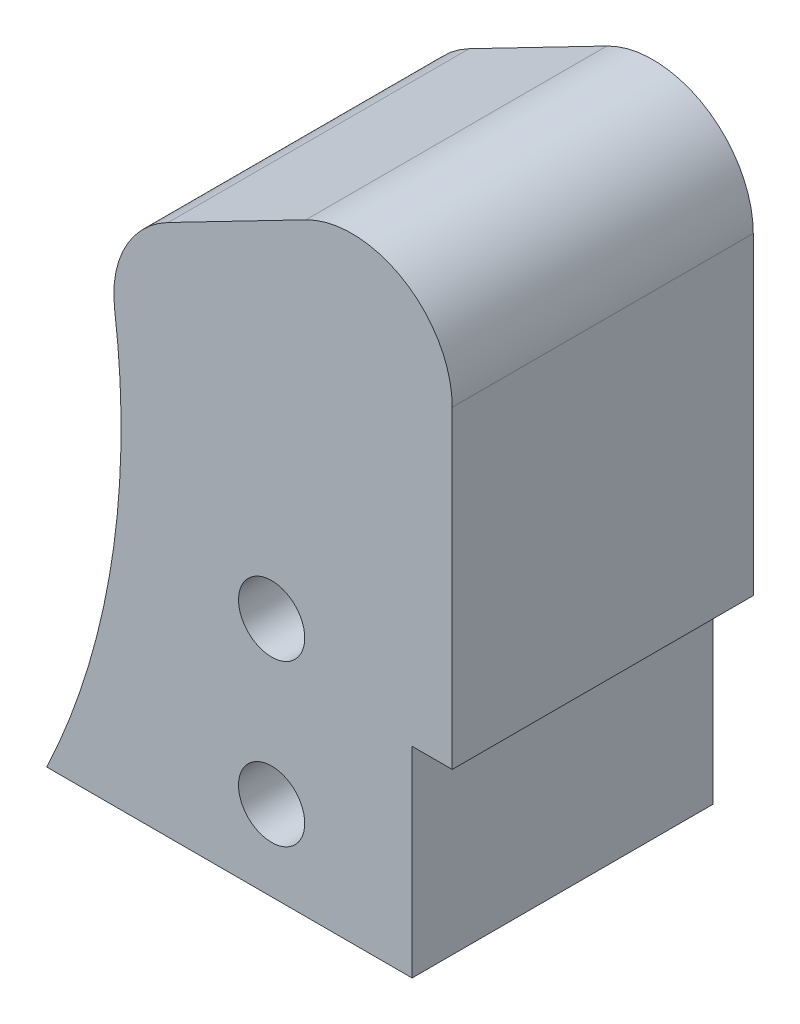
ISO-10303-21;
HEADER;
FILE_DESCRIPTION(('STEP AP214'),'2;1');
FILE_NAME('part.step','',(''),(''),'','','');
FILE_SCHEMA(('AUTOMOTIVE_DESIGN { 1 0 10303 214 1 1 1 1 }'));
ENDSEC;
DATA;
#1=APPLICATION_CONTEXT('core data for automotive mechanical design processes');
#2=APPLICATION_PROTOCOL_DEFINITION('international standard','automotive_design',2000,#1);
#3=PRODUCT_CONTEXT('',#1,'mechanical');
#4=PRODUCT('Part','Part','',(#3));
#5=PRODUCT_RELATED_PRODUCT_CATEGORY('part','',(#4));
#6=PRODUCT_DEFINITION_FORMATION('','',#4);
#7=PRODUCT_DEFINITION_CONTEXT('part definition',#1,'design');
#8=PRODUCT_DEFINITION('design','',#6,#7);
#9=PRODUCT_DEFINITION_SHAPE('','',#8);
#10=(LENGTH_UNIT() NAMED_UNIT(*) SI_UNIT(.MILLI.,.METRE.));
#11=(NAMED_UNIT(*) PLANE_ANGLE_UNIT() SI_UNIT($,.RADIAN.));
#12=(NAMED_UNIT(*) SI_UNIT($,.STERADIAN.) SOLID_ANGLE_UNIT());
#13=UNCERTAINTY_MEASURE_WITH_UNIT(LENGTH_MEASURE(1.E-05),#10,'distance_accuracy_value','');
#14=(GEOMETRIC_REPRESENTATION_CONTEXT(3) GLOBAL_UNCERTAINTY_ASSIGNED_CONTEXT((#13)) GLOBAL_UNIT_ASSIGNED_CONTEXT((#10,
#11,#12)) REPRESENTATION_CONTEXT('',''));
#15=CARTESIAN_POINT('',(0.,0.,0.));
#16=DIRECTION('',(0.,0.,1.));
#17=DIRECTION('',(1.,0.,0.));
#18=AXIS2_PLACEMENT_3D('',#15,#16,#17);
#19=CARTESIAN_POINT('',(50.,-1.16800875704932,8.));
#20=DIRECTION('',(0.,0.,1.));
#21=DIRECTION('',(1.,0.,0.));
#22=AXIS2_PLACEMENT_3D('',#19,#20,#21);
#23=CYLINDRICAL_SURFACE('',#22,5.);
#24=CARTESIAN_POINT('',(50.,-1.16800875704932,8.));
#25=DIRECTION('',(0.,0.,-1.));
#26=DIRECTION('',(1.,0.,0.));
#27=AXIS2_PLACEMENT_3D('',#24,#25,#26);
#28=CIRCLE('',#27,5.);
#29=CARTESIAN_POINT('',(47.7037551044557,3.27352919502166,8.));
#30=VERTEX_POINT('',#29);
#31=CARTESIAN_POINT('',(55.,-1.16800875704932,8.));
#32=VERTEX_POINT('',#31);
#33=EDGE_CURVE('E98',#30,#32,#28,.T.);
#34=ORIENTED_EDGE('',*,*,#33,.F.);
#35=DIRECTION('',(0.,0.,-1.));
#36=VECTOR('',#35,1.);
#37=CARTESIAN_POINT('',(47.7037551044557,3.27352919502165,8.));
#38=LINE('',#37,#36);
#39=CARTESIAN_POINT('',(47.7037551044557,3.27352919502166,23.));
#40=VERTEX_POINT('',#39);
#41=EDGE_CURVE('E26',#40,#30,#38,.T.);
#42=ORIENTED_EDGE('',*,*,#41,.F.);
#43=CARTESIAN_POINT('',(50.,-1.16800875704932,23.));
#44=DIRECTION('',(0.,0.,1.));
#45=DIRECTION('',(1.,0.,0.));
#46=AXIS2_PLACEMENT_3D('',#43,#44,#45);
#47=CIRCLE('',#46,5.);
#48=CARTESIAN_POINT('',(55.,-1.16800875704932,23.));
#49=VERTEX_POINT('',#48);
#50=EDGE_CURVE('E96',#49,#40,#47,.T.);
#51=ORIENTED_EDGE('',*,*,#50,.F.);
#52=DIRECTION('',(0.,0.,1.));
#53=VECTOR('',#52,1.);
#54=CARTESIAN_POINT('',(55.,-1.16800875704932,8.));
#55=LINE('',#54,#53);
#56=EDGE_CURVE('E135',#32,#49,#55,.T.);
#57=ORIENTED_EDGE('',*,*,#56,.F.);
#58=EDGE_LOOP('',(#34,#42,#51,#57));
#59=FACE_BOUND('',#58,.T.);
#60=ADVANCED_FACE('F17',(#59),#23,.T.);
#61=CARTESIAN_POINT('',(8.72573060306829,-16.8778442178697,8.));
#62=DIRECTION('',(0.459248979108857,-0.888307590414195,0.));
#63=DIRECTION('',(0.,0.,-1.));
#64=AXIS2_PLACEMENT_3D('',#61,#62,#63);
#65=PLANE('',#64);
#66=DIRECTION('',(0.888307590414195,0.459248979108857,0.));
#67=VECTOR('',#66,1.);
#68=CARTESIAN_POINT('',(8.72573060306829,-16.8778442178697,23.));
#69=LINE('',#68,#67);
#70=CARTESIAN_POINT('',(40.8418007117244,-0.274054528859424,23.));
#71=VERTEX_POINT('',#70);
#72=EDGE_CURVE('E101',#71,#40,#69,.T.);
#73=ORIENTED_EDGE('',*,*,#72,.T.);
#74=ORIENTED_EDGE('',*,*,#41,.T.);
#75=DIRECTION('',(0.888307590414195,0.459248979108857,0.));
#76=VECTOR('',#75,1.);
#77=CARTESIAN_POINT('',(8.72573060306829,-16.8778442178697,8.));
#78=LINE('',#77,#76);
#79=CARTESIAN_POINT('',(40.8418007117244,-0.274054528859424,8.));
#80=VERTEX_POINT('',#79);
#81=EDGE_CURVE('E106',#80,#30,#78,.T.);
#82=ORIENTED_EDGE('',*,*,#81,.F.);
#83=DIRECTION('',(0.,0.,1.));
#84=VECTOR('',#83,1.);
#85=CARTESIAN_POINT('',(40.8418007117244,-0.274054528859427,23.));
#86=LINE('',#85,#84);
#87=EDGE_CURVE('E11',#80,#71,#86,.T.);
#88=ORIENTED_EDGE('',*,*,#87,.T.);
#89=EDGE_LOOP('',(#73,#74,#82,#88));
#90=FACE_BOUND('',#89,.T.);
#91=ADVANCED_FACE('F102',(#90),#65,.F.);
#92=CARTESIAN_POINT('',(0.,0.,8.));
#93=DIRECTION('',(0.,0.,1.));
#94=DIRECTION('',(1.,0.,0.));
#95=AXIS2_PLACEMENT_3D('',#92,#93,#94);
#96=PLANE('',#95);
#97=CARTESIAN_POINT('',(46.,-22.7966896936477,8.));
#98=DIRECTION('',(0.,0.,-1.));
#99=DIRECTION('',(1.,0.,0.));
#100=AXIS2_PLACEMENT_3D('',#97,#98,#99);
#101=CIRCLE('',#100,1.65);
#102=CARTESIAN_POINT('',(47.65,-22.7966896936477,8.));
#103=VERTEX_POINT('',#102);
#104=EDGE_CURVE('E139',#103,#103,#101,.T.);
#105=ORIENTED_EDGE('',*,*,#104,.F.);
#106=EDGE_LOOP('',(#105));
#107=FACE_BOUND('',#106,.T.);
#108=CARTESIAN_POINT('',(46.,-14.7966896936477,8.));
#109=DIRECTION('',(0.,0.,-1.));
#110=DIRECTION('',(1.,0.,0.));
#111=AXIS2_PLACEMENT_3D('',#108,#109,#110);
#112=CIRCLE('',#111,1.65);
#113=CARTESIAN_POINT('',(47.65,-14.7966896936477,8.));
#114=VERTEX_POINT('',#113);
#115=EDGE_CURVE('E133',#114,#114,#112,.T.);
#116=ORIENTED_EDGE('',*,*,#115,.F.);
#117=EDGE_LOOP('',(#116));
#118=FACE_BOUND('',#117,.T.);
#119=ORIENTED_EDGE('',*,*,#81,.T.);
#120=ORIENTED_EDGE('',*,*,#33,.T.);
#121=DIRECTION('',(0.,1.,0.));
#122=VECTOR('',#121,1.);
#123=CARTESIAN_POINT('',(55.,-68.,8.));
#124=LINE('',#123,#122);
#125=CARTESIAN_POINT('',(55.,-16.7966896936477,8.));
#126=VERTEX_POINT('',#125);
#127=EDGE_CURVE('E138',#126,#32,#124,.T.);
#128=ORIENTED_EDGE('',*,*,#127,.F.);
#129=DIRECTION('',(1.,0.,0.));
#130=VECTOR('',#129,1.);
#131=CARTESIAN_POINT('',(0.,-16.7966896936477,8.));
#132=LINE('',#131,#130);
#133=CARTESIAN_POINT('',(53.,-16.7966896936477,8.));
#134=VERTEX_POINT('',#133);
#135=EDGE_CURVE('E119',#134,#126,#132,.T.);
#136=ORIENTED_EDGE('',*,*,#135,.F.);
#137=DIRECTION('',(0.,1.,0.));
#138=VECTOR('',#137,1.);
#139=CARTESIAN_POINT('',(53.,0.,8.));
#140=LINE('',#139,#138);
#141=CARTESIAN_POINT('',(53.,-26.7966896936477,8.));
#142=VERTEX_POINT('',#141);
#143=EDGE_CURVE('E168',#142,#134,#140,.T.);
#144=ORIENTED_EDGE('',*,*,#143,.F.);
#145=DIRECTION('',(1.,0.,0.));
#146=VECTOR('',#145,1.);
#147=CARTESIAN_POINT('',(0.,-26.7966896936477,8.));
#148=LINE('',#147,#146);
#149=CARTESIAN_POINT('',(34.7939729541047,-26.7966896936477,8.));
#150=VERTEX_POINT('',#149);
#151=EDGE_CURVE('E159',#150,#142,#148,.T.);
#152=ORIENTED_EDGE('',*,*,#151,.F.);
#153=CARTESIAN_POINT('',(0.,-10.3155050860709,8.));
#154=DIRECTION('',(0.,0.,1.));
#155=DIRECTION('',(1.,0.,0.));
#156=AXIS2_PLACEMENT_3D('',#153,#154,#155);
#157=CIRCLE('',#156,38.5);
#158=CARTESIAN_POINT('',(38.1796495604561,-5.35926059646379,8.));
#159=VERTEX_POINT('',#158);
#160=EDGE_CURVE('E152',#150,#159,#157,.T.);
#161=ORIENTED_EDGE('',*,*,#160,.T.);
#162=CARTESIAN_POINT('',(43.1380456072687,-4.7155924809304,8.));
#163=DIRECTION('',(0.,0.,-1.));
#164=DIRECTION('',(1.,0.,0.));
#165=AXIS2_PLACEMENT_3D('',#162,#163,#164);
#166=CIRCLE('',#165,5.);
#167=EDGE_CURVE('E52',#159,#80,#166,.T.);
#168=ORIENTED_EDGE('',*,*,#167,.T.);
#169=EDGE_LOOP('',(#119,#120,#128,#136,#144,#152,#161,#168));
#170=FACE_BOUND('',#169,.T.);
#171=ADVANCED_FACE('F19',(#107,#118,#170),#96,.F.);
#172=CARTESIAN_POINT('',(0.,0.,23.));
#173=DIRECTION('',(0.,0.,1.));
#174=DIRECTION('',(1.,0.,0.));
#175=AXIS2_PLACEMENT_3D('',#172,#173,#174);
#176=PLANE('',#175);
#177=CARTESIAN_POINT('',(46.,-14.7966896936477,23.));
#178=DIRECTION('',(0.,0.,-1.));
#179=DIRECTION('',(1.,0.,0.));
#180=AXIS2_PLACEMENT_3D('',#177,#178,#179);
#181=CIRCLE('',#180,1.65);
#182=CARTESIAN_POINT('',(47.65,-14.7966896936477,23.));
#183=VERTEX_POINT('',#182);
#184=EDGE_CURVE('E208',#183,#183,#181,.T.);
#185=ORIENTED_EDGE('',*,*,#184,.T.);
#186=EDGE_LOOP('',(#185));
#187=FACE_BOUND('',#186,.T.);
#188=CARTESIAN_POINT('',(46.,-22.7966896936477,23.));
#189=DIRECTION('',(0.,0.,-1.));
#190=DIRECTION('',(1.,0.,0.));
#191=AXIS2_PLACEMENT_3D('',#188,#189,#190);
#192=CIRCLE('',#191,1.65);
#193=CARTESIAN_POINT('',(47.65,-22.7966896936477,23.));
#194=VERTEX_POINT('',#193);
#195=EDGE_CURVE('E143',#194,#194,#192,.T.);
#196=ORIENTED_EDGE('',*,*,#195,.T.);
#197=EDGE_LOOP('',(#196));
#198=FACE_BOUND('',#197,.T.);
#199=DIRECTION('',(0.,1.,0.));
#200=VECTOR('',#199,1.);
#201=CARTESIAN_POINT('',(55.,0.,23.));
#202=LINE('',#201,#200);
#203=CARTESIAN_POINT('',(55.,-16.7966896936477,23.));
#204=VERTEX_POINT('',#203);
#205=EDGE_CURVE('E110',#204,#49,#202,.T.);
#206=ORIENTED_EDGE('',*,*,#205,.T.);
#207=ORIENTED_EDGE('',*,*,#50,.T.);
#208=ORIENTED_EDGE('',*,*,#72,.F.);
#209=CARTESIAN_POINT('',(43.1380456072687,-4.7155924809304,23.));
#210=DIRECTION('',(0.,0.,1.));
#211=DIRECTION('',(1.,0.,0.));
#212=AXIS2_PLACEMENT_3D('',#209,#210,#211);
#213=CIRCLE('',#212,5.);
#214=CARTESIAN_POINT('',(38.1796495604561,-5.35926059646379,23.));
#215=VERTEX_POINT('',#214);
#216=EDGE_CURVE('E195',#71,#215,#213,.T.);
#217=ORIENTED_EDGE('',*,*,#216,.T.);
#218=CARTESIAN_POINT('',(0.,-10.3155050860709,23.));
#219=DIRECTION('',(0.,0.,1.));
#220=DIRECTION('',(1.,0.,0.));
#221=AXIS2_PLACEMENT_3D('',#218,#219,#220);
#222=CIRCLE('',#221,38.5);
#223=CARTESIAN_POINT('',(34.7939729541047,-26.7966896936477,23.));
#224=VERTEX_POINT('',#223);
#225=EDGE_CURVE('E148',#224,#215,#222,.T.);
#226=ORIENTED_EDGE('',*,*,#225,.F.);
#227=DIRECTION('',(1.,0.,0.));
#228=VECTOR('',#227,1.);
#229=CARTESIAN_POINT('',(0.,-26.7966896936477,23.));
#230=LINE('',#229,#228);
#231=CARTESIAN_POINT('',(53.,-26.7966896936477,23.));
#232=VERTEX_POINT('',#231);
#233=EDGE_CURVE('E164',#224,#232,#230,.T.);
#234=ORIENTED_EDGE('',*,*,#233,.T.);
#235=DIRECTION('',(0.,1.,0.));
#236=VECTOR('',#235,1.);
#237=CARTESIAN_POINT('',(53.,0.,23.));
#238=LINE('',#237,#236);
#239=CARTESIAN_POINT('',(53.,-16.7966896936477,23.));
#240=VERTEX_POINT('',#239);
#241=EDGE_CURVE('E173',#232,#240,#238,.T.);
#242=ORIENTED_EDGE('',*,*,#241,.T.);
#243=DIRECTION('',(1.,0.,0.));
#244=VECTOR('',#243,1.);
#245=CARTESIAN_POINT('',(0.,-16.7966896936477,23.));
#246=LINE('',#245,#244);
#247=EDGE_CURVE('E113',#240,#204,#246,.T.);
#248=ORIENTED_EDGE('',*,*,#247,.T.);
#249=EDGE_LOOP('',(#206,#207,#208,#217,#226,#234,#242,#248));
#250=FACE_BOUND('',#249,.T.);
#251=ADVANCED_FACE('F108',(#187,#198,#250),#176,.T.);
#252=CARTESIAN_POINT('',(0.,-16.7966896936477,23.));
#253=DIRECTION('',(0.,1.,0.));
#254=DIRECTION('',(1.,0.,0.));
#255=AXIS2_PLACEMENT_3D('',#252,#253,#254);
#256=PLANE('',#255);
#257=ORIENTED_EDGE('',*,*,#135,.T.);
#258=DIRECTION('',(0.,0.,-1.));
#259=VECTOR('',#258,1.);
#260=CARTESIAN_POINT('',(55.,-16.7966896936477,23.));
#261=LINE('',#260,#259);
#262=EDGE_CURVE('E144',#204,#126,#261,.T.);
#263=ORIENTED_EDGE('',*,*,#262,.F.);
#264=ORIENTED_EDGE('',*,*,#247,.F.);
#265=DIRECTION('',(0.,0.,-1.));
#266=VECTOR('',#265,1.);
#267=CARTESIAN_POINT('',(53.,-16.7966896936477,23.));
#268=LINE('',#267,#266);
#269=EDGE_CURVE('E169',#240,#134,#268,.T.);
#270=ORIENTED_EDGE('',*,*,#269,.T.);
#271=EDGE_LOOP('',(#257,#263,#264,#270));
#272=FACE_BOUND('',#271,.T.);
#273=ADVANCED_FACE('F182',(#272),#256,.F.);
#274=CARTESIAN_POINT('',(53.,0.,23.));
#275=DIRECTION('',(-1.,0.,0.));
#276=DIRECTION('',(0.,0.,1.));
#277=AXIS2_PLACEMENT_3D('',#274,#275,#276);
#278=PLANE('',#277);
#279=ORIENTED_EDGE('',*,*,#143,.T.);
#280=ORIENTED_EDGE('',*,*,#269,.F.);
#281=ORIENTED_EDGE('',*,*,#241,.F.);
#282=DIRECTION('',(0.,0.,-1.));
#283=VECTOR('',#282,1.);
#284=CARTESIAN_POINT('',(53.,-26.7966896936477,23.));
#285=LINE('',#284,#283);
#286=EDGE_CURVE('E163',#232,#142,#285,.T.);
#287=ORIENTED_EDGE('',*,*,#286,.T.);
#288=EDGE_LOOP('',(#279,#280,#281,#287));
#289=FACE_BOUND('',#288,.T.);
#290=ADVANCED_FACE('F242',(#289),#278,.F.);
#291=CARTESIAN_POINT('',(0.,-26.7966896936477,23.));
#292=DIRECTION('',(0.,1.,0.));
#293=DIRECTION('',(1.,0.,0.));
#294=AXIS2_PLACEMENT_3D('',#291,#292,#293);
#295=PLANE('',#294);
#296=ORIENTED_EDGE('',*,*,#151,.T.);
#297=ORIENTED_EDGE('',*,*,#286,.F.);
#298=ORIENTED_EDGE('',*,*,#233,.F.);
#299=DIRECTION('',(0.,0.,-1.));
#300=VECTOR('',#299,1.);
#301=CARTESIAN_POINT('',(34.7939729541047,-26.7966896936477,23.));
#302=LINE('',#301,#300);
#303=EDGE_CURVE('E155',#224,#150,#302,.T.);
#304=ORIENTED_EDGE('',*,*,#303,.T.);
#305=EDGE_LOOP('',(#296,#297,#298,#304));
#306=FACE_BOUND('',#305,.T.);
#307=ADVANCED_FACE('F245',(#306),#295,.F.);
#308=CARTESIAN_POINT('',(0.,-10.3155050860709,23.));
#309=DIRECTION('',(0.,0.,-1.));
#310=DIRECTION('',(-1.,0.,0.));
#311=AXIS2_PLACEMENT_3D('',#308,#309,#310);
#312=CYLINDRICAL_SURFACE('',#311,38.5);
#313=ORIENTED_EDGE('',*,*,#225,.T.);
#314=DIRECTION('',(0.,0.,-1.));
#315=VECTOR('',#314,1.);
#316=CARTESIAN_POINT('',(38.1796495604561,-5.35926059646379,23.));
#317=LINE('',#316,#315);
#318=EDGE_CURVE('E212',#215,#159,#317,.T.);
#319=ORIENTED_EDGE('',*,*,#318,.T.);
#320=ORIENTED_EDGE('',*,*,#160,.F.);
#321=ORIENTED_EDGE('',*,*,#303,.F.);
#322=EDGE_LOOP('',(#313,#319,#320,#321));
#323=FACE_BOUND('',#322,.T.);
#324=ADVANCED_FACE('F223',(#323),#312,.F.);
#325=CARTESIAN_POINT('',(55.,-68.,8.));
#326=DIRECTION('',(-1.,0.,0.));
#327=DIRECTION('',(0.,0.,1.));
#328=AXIS2_PLACEMENT_3D('',#325,#326,#327);
#329=PLANE('',#328);
#330=ORIENTED_EDGE('',*,*,#127,.T.);
#331=ORIENTED_EDGE('',*,*,#56,.T.);
#332=ORIENTED_EDGE('',*,*,#205,.F.);
#333=ORIENTED_EDGE('',*,*,#262,.T.);
#334=EDGE_LOOP('',(#330,#331,#332,#333));
#335=FACE_BOUND('',#334,.T.);
#336=ADVANCED_FACE('F188',(#335),#329,.F.);
#337=CARTESIAN_POINT('',(46.,-22.7966896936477,27.));
#338=DIRECTION('',(0.,0.,-1.));
#339=DIRECTION('',(-1.,0.,0.));
#340=AXIS2_PLACEMENT_3D('',#337,#338,#339);
#341=CYLINDRICAL_SURFACE('',#340,1.65);
#342=ORIENTED_EDGE('',*,*,#104,.T.);
#343=EDGE_LOOP('',(#342));
#344=FACE_BOUND('',#343,.T.);
#345=ORIENTED_EDGE('',*,*,#195,.F.);
#346=EDGE_LOOP('',(#345));
#347=FACE_BOUND('',#346,.T.);
#348=ADVANCED_FACE('F274',(#344,#347),#341,.F.);
#349=CARTESIAN_POINT('',(46.,-14.7966896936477,27.));
#350=DIRECTION('',(0.,0.,-1.));
#351=DIRECTION('',(-1.,0.,0.));
#352=AXIS2_PLACEMENT_3D('',#349,#350,#351);
#353=CYLINDRICAL_SURFACE('',#352,1.65);
#354=ORIENTED_EDGE('',*,*,#115,.T.);
#355=EDGE_LOOP('',(#354));
#356=FACE_BOUND('',#355,.T.);
#357=ORIENTED_EDGE('',*,*,#184,.F.);
#358=EDGE_LOOP('',(#357));
#359=FACE_BOUND('',#358,.T.);
#360=ADVANCED_FACE('F277',(#356,#359),#353,.F.);
#361=CARTESIAN_POINT('',(43.1380456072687,-4.7155924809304,23.));
#362=DIRECTION('',(0.,0.,-1.));
#363=DIRECTION('',(-1.,0.,0.));
#364=AXIS2_PLACEMENT_3D('',#361,#362,#363);
#365=CYLINDRICAL_SURFACE('',#364,5.);
#366=ORIENTED_EDGE('',*,*,#216,.F.);
#367=ORIENTED_EDGE('',*,*,#87,.F.);
#368=ORIENTED_EDGE('',*,*,#167,.F.);
#369=ORIENTED_EDGE('',*,*,#318,.F.);
#370=EDGE_LOOP('',(#366,#367,#368,#369));
#371=FACE_BOUND('',#370,.T.);
#372=ADVANCED_FACE('F230',(#371),#365,.T.);
#373=CLOSED_SHELL('',(#60,#91,#171,#251,#273,#290,#307,#324,#336,#348,#360,#372));
#374=MANIFOLD_SOLID_BREP('B1',#373);
#375=ADVANCED_BREP_SHAPE_REPRESENTATION('',(#18,#374),#14);
#376=SHAPE_DEFINITION_REPRESENTATION(#9,#375);
ENDSEC;
END-ISO-10303-21;
